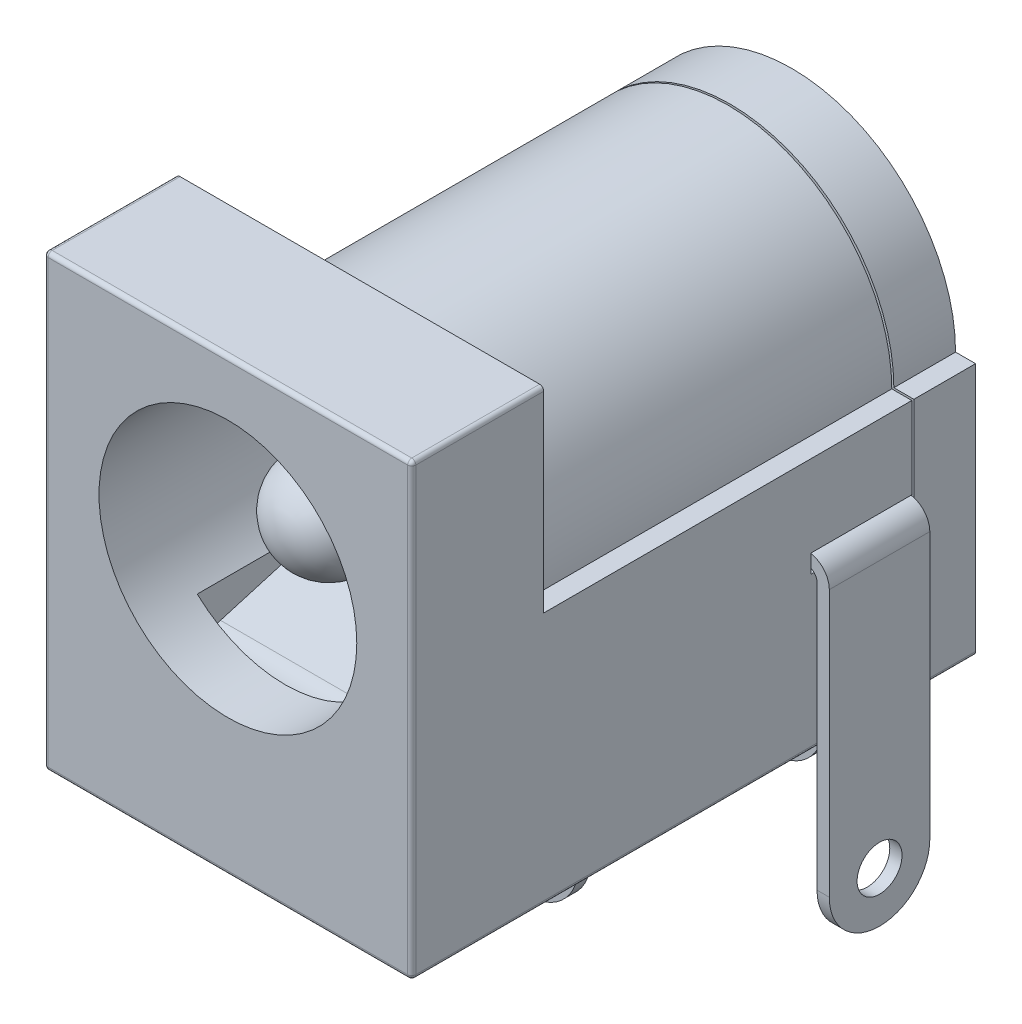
from build123d import *

# Parameters (mm, degrees)
ESBO_O1_W                      = 9
ESBO_O1_H                      = 11
RESSALTO_EXTRUS_O1_DEPTH       = 6.12
CORTE_EXTRUS_O1_DEPTH          = 9.01
RESSALTO_EXTRUS_O2_DEPTH       = 0.05
RESSALTO_EXTRUS_O3_START       = 1.51
RESSALTO_EXTRUS_O3_DEPTH       = 1.51
CORTE_EXTRUS_O2_DEPTH          = 0.45
RESSALTO_EXTRUS_O4_DEPTH       = 0.3
ESBO_O8_R                      = 3.155
CORTE_EXTRUS_O3_DEPTH          = 12.24
ESBO_O9_R                      = 1.45
RESSALTO_EXTRUS_O6_DEPTH       = 0.1
ESBO_O10_R                     = 1.25
RESSALTO_EXTRUS_O7_DEPTH       = 11.02
FILETE1_R                      = 1.25
RESSALTO_EXTRUS_O8_DEPTH       = 0.3
CORTE_EXTRUS_O4_DEPTH          = 0.5
ESBO_O13_W                     = 2.46
ESBO_O13_H                     = 4.64
RESSALTO_EXTRUS_O9_DEPTH       = 0.5
FURO1_D                        = 1.1
CORTE_EXTRUS_O6_DEPTH          = 2.15
RESSALTO_EXTRUS_O10_DEPTH      = 2.05
RESSALTO_EXTRUS_O10_DEPTH_BACK = 2.05
FURO2_D                        = 1.3
FURO2_DEPTH                    = 1
FURO2_TIP                      = 0.390559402
FILETE2_R                      = 0.3
FILETE3_R                      = 0.1
ESBO_O21_W                     = 2.52
ESBO_O21_H                     = 0.45
CORTE_EXTRUS_O7_DEPTH          = 0.5
RESSALTO_EXTRUS_O11_DEPTH      = 2.46
CORTE_EXTRUS_O8_DEPTH          = 17.209535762
FURO3_D                        = 1.1


with BuildPart() as part:
    # Esbo_o1 → Ressalto-extrus_o1 (new, symmetric)
    with BuildSketch(Plane.XY):
        with Locations((0, -1)):
            Rectangle(ESBO_O1_W, ESBO_O1_H)
    extrude(amount=RESSALTO_EXTRUS_O1_DEPTH, both=True)

    # Esbo_o2 → Corte-extrus_o1 (cut)
    with BuildSketch(Plane(origin=(0, 0, -6.12), x_dir=(-1, 0, 0), z_dir=(0, 0, -1))):
        with BuildLine():
            Line((-4.5, -0.3), (-4.01, -0.3))
            ThreePointArc((-4.01, -0.3), (0, 3.71), (4.01, -0.3))
            Line((4.01, -0.3), (4.5, -0.3))
            Line((4.5, -0.3), (4.5, 4.5))
            Line((4.5, 4.5), (-4.5, 4.5))
            Line((-4.5, 4.5), (-4.5, -0.3))
        make_face()
    extrude(amount=-CORTE_EXTRUS_O1_DEPTH, mode=Mode.SUBTRACT)

    # Esbo_o3 → Ressalto-extrus_o2 (add)
    with BuildSketch(Plane(origin=(0, 0, -6.12), x_dir=(-1, 0, 0), z_dir=(0, 0, -1))):
        with BuildLine():
            Line((-3.474204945, -0.8), (-4, -0.8))
            Line((-4, -0.8), (-4, -6))
            Line((-4, -6), (4, -6))
            Line((4, -6), (4, -0.8))
            Line((4, -0.8), (3.474204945, -0.8))
            ThreePointArc((3.474204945, -0.8), (0, 3.21), (-3.474204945, -0.8))
        make_face()
    extrude(amount=RESSALTO_EXTRUS_O2_DEPTH)

    # Esbo_o4 → Ressalto-extrus_o3 (add)
    with BuildSketch(Plane(origin=(0, 0, -6.17), x_dir=(-1, 0, 0), z_dir=(0, 0, -1)).offset(RESSALTO_EXTRUS_O3_START)):
        with BuildLine():
            Line((-4.01, -0.3), (-4.5, -0.3))
            Line((-4.5, -0.3), (-4.5, -6.5))
            Line((-4.5, -6.5), (4.5, -6.5))
            Line((4.5, -6.5), (4.5, -0.3))
            Line((4.5, -0.3), (4.01, -0.3))
            ThreePointArc((4.01, -0.3), (0, 3.71), (-4.01, -0.3))
        make_face()
    extrude(amount=-RESSALTO_EXTRUS_O3_DEPTH)

    # Esbo_o5 → Corte-extrus_o2 (cut)
    with BuildSketch(Plane(origin=(0, 0, -7.68), x_dir=(-1, 0, 0), z_dir=(0, 0, -1))):
        with BuildLine():
            Line((0.892426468, 1.84), (-0.892426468, 1.84))
            ThreePointArc((-0.892426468, 1.84), (-2.032104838, 0.229292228), (-1.28, -1.594874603))
            Line((-1.28, -1.594874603), (-1.28, -6.5))
            Line((-1.28, -6.5), (1.28, -6.5))
            Line((1.28, -6.5), (1.28, -1.594874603))
            ThreePointArc((1.28, -1.594874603), (2.032104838, 0.229292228), (0.892426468, 1.84))
        make_face()
    extrude(amount=-CORTE_EXTRUS_O2_DEPTH, mode=Mode.SUBTRACT)

    # Esbo_o6 → Ressalto-extrus_o4 (add)
    with BuildSketch(Plane(origin=(0, 0, -7.23), x_dir=(-1, 0, 0), z_dir=(0, 0, -1))):
        with BuildLine():
            Line((1.23, -9.37), (1.23, -1.570708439))
            ThreePointArc((1.23, -1.570708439), (1.984320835, 0.206145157), (0.880866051, 1.79))
            Line((0.880866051, 1.79), (-0.880866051, 1.79))
            ThreePointArc((-0.880866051, 1.79), (-1.984320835, 0.206145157), (-1.23, -1.570708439))
            Line((-1.23, -1.570708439), (-1.23, -9.37))
            ThreePointArc((-1.23, -9.37), (0, -10.6), (1.23, -9.37))
        make_face()
    extrude(amount=RESSALTO_EXTRUS_O4_DEPTH)

    # Esbo_o8 → Corte-extrus_o3 (cut)
    with BuildSketch(Plane.XY.offset(6.12)):
        Circle(ESBO_O8_R)
    extrude(amount=-CORTE_EXTRUS_O3_DEPTH, mode=Mode.SUBTRACT)

    # Esbo_o9 → Ressalto-extrus_o6 (add)
    with BuildSketch(Plane.XY.offset(-6.12)):
        with Locations(Location((0, 0, 0), (0, 0, 180))):
            Circle(ESBO_O9_R)
    extrude(amount=RESSALTO_EXTRUS_O6_DEPTH)

    # Esbo_o10 → Ressalto-extrus_o7 (add)
    with BuildSketch(Plane.XY.offset(-6.12)):
        Circle(ESBO_O10_R)
    extrude(amount=RESSALTO_EXTRUS_O7_DEPTH)

    # Filete1
    filete1_edges = [part.edges().sort_by_distance(p)[0] for p in [
        (-1.25, 0, 4.9),
    ]]
    fillet(filete1_edges, radius=FILETE1_R)

    # Esbo_o11 → Ressalto-extrus_o8 (add)
    with BuildSketch(Plane.XY.offset(-1.23)):
        with BuildLine():
            Line((1.23, -9.37), (1.23, -5.5))
            Line((1.23, -5.5), (-1.23, -5.5))
            Line((-1.23, -5.5), (-1.23, -9.37))
            ThreePointArc((-1.23, -9.37), (0, -10.6), (1.23, -9.37))
        make_face()
    extrude(amount=-RESSALTO_EXTRUS_O8_DEPTH)

    # Esbo_o12 → Corte-extrus_o4 (cut)
    with BuildSketch(Plane.XZ.offset(6.5)):
        Polygon((-1.28, -1.23), (-1.23, -1.23), (-1.23, -1.53), (1.23, -1.53), (1.23, -1.23), (1.28, -1.23), (1.28, -6.17), (-1.28, -6.17), align=None)
    extrude(amount=-CORTE_EXTRUS_O4_DEPTH, mode=Mode.SUBTRACT)

    # Esbo_o13 → Ressalto-extrus_o9 (add)
    with BuildSketch(Plane.XZ.offset(6)):
        with Locations((0, -3.85)):
            Rectangle(ESBO_O13_W, ESBO_O13_H)
    extrude(amount=RESSALTO_EXTRUS_O9_DEPTH)

    # Furo1 (through all)
    with Locations(Plane(origin=(0, 0, -7.53), x_dir=(-1, 0, 0), z_dir=(0, 0, -1))):
        with Locations((0, -9.37)):
            Hole(FURO1_D / 2)

    # Esbo_o16 → Corte-extrus_o6 (cut, symmetric)
    with BuildSketch(Plane(origin=(0, 0, 0), x_dir=(0, 0, -1), z_dir=(1, 0, 0))):
        Polygon((-4.72, -3.155), (-4.72, -4.155), (1.53, -4.155), (1.53, -3.155), (1.53, -2.155), (-4.72, -2.155), align=None)
    extrude(amount=CORTE_EXTRUS_O6_DEPTH, both=True, mode=Mode.SUBTRACT)

    # Esbo_o17 → Ressalto-extrus_o10 (add, two sides: drawn at the far end of the back side and taken through both)
    with BuildSketch(Plane(origin=(0, 0, 0), x_dir=(0, 0, -1), z_dir=(1, 0, 0)).offset(-RESSALTO_EXTRUS_O10_DEPTH_BACK)):
        with BuildLine():
            Line((1.23, -6.5), (1.53, -6.5))
            Line((1.53, -6.5), (1.53, -4.267800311))
            ThreePointArc((1.53, -4.267800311), (1.379804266, -3.905195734), (1.017199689, -3.755))
            Line((1.017199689, -3.755), (-4.107199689, -3.755))
            ThreePointArc((-4.107199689, -3.755), (-4.317851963, -3.57235913), (-4.166909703, -3.337948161))
            Line((-4.166909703, -3.337948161), (0.47197784, -1.981835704))
            ThreePointArc((0.47197784, -1.981835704), (0.633894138, -1.999438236), (0.735939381, -2.126377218))
            Line((0.735939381, -2.126377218), (0.853749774, -2.529374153))
            ThreePointArc((0.853749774, -2.529374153), (1.038395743, -2.795821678), (1.345949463, -2.898286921))
            Line((1.345949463, -2.898286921), (5.02, -2.898286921))
            Line((5.02, -2.898286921), (5.02, -2.598286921))
            Line((5.02, -2.598286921), (1.345949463, -2.598286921))
            ThreePointArc((1.345949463, -2.598286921), (1.218321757, -2.555766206), (1.141697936, -2.445196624))
            Line((1.141697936, -2.445196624), (1.023887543, -2.042199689))
            ThreePointArc((1.023887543, -2.042199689), (0.777981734, -1.736305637), (0.387800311, -1.693887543))
            Line((0.387800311, -1.693887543), (-4.251087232, -3.05))
            ThreePointArc((-4.251087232, -3.05), (-4.614823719, -3.614877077), (-4.107199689, -4.055))
            Line((-4.107199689, -4.055), (1.017199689, -4.055))
            ThreePointArc((1.017199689, -4.055), (1.167672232, -4.117327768), (1.23, -4.267800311))
            Line((1.23, -4.267800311), (1.23, -6.5))
        make_face()
    extrude(amount=RESSALTO_EXTRUS_O10_DEPTH + RESSALTO_EXTRUS_O10_DEPTH_BACK)

    # Furo2
    with Locations(Plane(origin=(0, 0, -7.53), x_dir=(-1, 0, 0), z_dir=(0, 0, -1))):
        with Locations((0, 0)):
            Hole(FURO2_D / 2, depth=FURO2_DEPTH)
            with Locations((0, 0, -(FURO2_DEPTH + FURO2_TIP / 2))):  # 118° drill point
                Cone(0, FURO2_D / 2, FURO2_TIP, mode=Mode.SUBTRACT)

    # Esbo_o20 → Revolu_o1 (revolve)
    with BuildSketch(Plane(origin=(0, 0, 0), x_dir=(0, 0, -1), z_dir=(1, 0, 0)), mode=Mode.PRIVATE) as revolu_o1_sk:
        Polygon((7.53, 0.65), (7.815788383, 1.145), (7.599282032, 1.27), (7.53, 1.15), align=None)
    revolve(revolu_o1_sk.sketch.rotate(Axis((0, 0, -7.53), (0, 0, -1)), 90), axis=Axis((0, 0, -7.53), (0, 0, -1)))

    # Filete2
    filete2_edges = [part.edges().sort_by_distance(p)[0] for p in [
        (-0.65, 0, -7.53),
    ]]
    fillet(filete2_edges, radius=FILETE2_R)

    # Filete3
    filete3_edges = [part.edges().sort_by_distance(p)[0] for p in [
        (-4.5, -1, 6.12),
        (0, -6.5, 6.12),
        (4.5, -1, 6.12),
        (-4.5, -6.5, -6.925),
        (4.5, -6.5, -6.925),
        (0, 4.5, 6.12),
        (4.5, -6.5, 0),
        (-4.5, -6.5, 0),
        (-4.5, 4.5, 4.505),
        (4.5, 4.5, 4.505),
    ]]
    fillet(filete3_edges, radius=FILETE3_R)

    # Esbo_o21 → Corte-extrus_o7 (cut)
    with BuildSketch(Plane(origin=(4.5, 0, 0), x_dir=(0, 0, -1), z_dir=(1, 0, 0))):
        with Locations((4.91, -2.525)):
            Rectangle(ESBO_O21_W, ESBO_O21_H)
    extrude(amount=-CORTE_EXTRUS_O7_DEPTH, mode=Mode.SUBTRACT)

    # Esbo_o22 → Ressalto-extrus_o11 (add)
    with BuildSketch(Plane(origin=(0, 0, -3.65), x_dir=(-1, 0, 0), z_dir=(0, 0, -1))):
        with BuildLine():
            Line((-4.65, -2.85), (-4.65, -10.6))
            Line((-4.65, -10.6), (-4.95, -10.6))
            Line((-4.95, -10.6), (-4.95, -2.85))
            ThreePointArc((-4.95, -2.85), (-4.78890873, -2.46109127), (-4.4, -2.3))
            Line((-4.4, -2.3), (2.05, -2.3))
            Line((2.05, -2.3), (2.05, -2.6))
            Line((2.05, -2.6), (-4.4, -2.6))
            ThreePointArc((-4.4, -2.6), (-4.576776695, -2.673223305), (-4.65, -2.85))
        make_face()
    extrude(amount=RESSALTO_EXTRUS_O11_DEPTH)

    # Esbo_o23 → Corte-extrus_o8 (cut, through all)
    with BuildSketch(Plane(origin=(4.95, 0, 0), x_dir=(0, 0, -1), z_dir=(1, 0, 0))):
        with BuildLine():
            Line((3.65, -9.37), (3.65, -10.6))
            Line((3.65, -10.6), (4.88, -10.6))
            ThreePointArc((4.88, -10.6), (4.010258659, -10.239741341), (3.65, -9.37))
        make_face()
        with BuildLine():
            ThreePointArc((6.11, -9.37), (5.749741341, -10.239741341), (4.88, -10.6))
            Line((4.88, -10.6), (6.11, -10.6))
            Line((6.11, -10.6), (6.11, -9.37))
        make_face()
    extrude(amount=-CORTE_EXTRUS_O8_DEPTH, mode=Mode.SUBTRACT)

    # Furo3 (through all)
    with Locations(Plane(origin=(4.95, 0, 0), x_dir=(0, 0, -1), z_dir=(1, 0, 0))):
        with Locations((4.88, -9.37)):
            Hole(FURO3_D / 2)


solid = part.part
